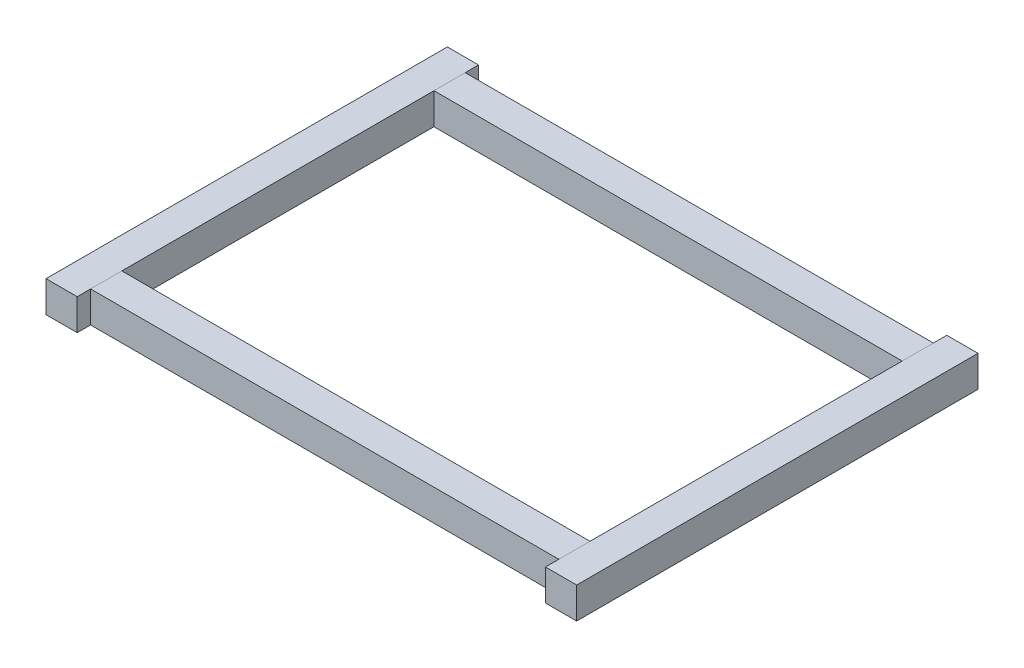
from build123d import *

# Parameters (mm, degrees)
ESQUISSE1_W          = 14
ESQUISSE1_H          = 14
BOSS_EXTRU_1_DEPTH   = 180
BOSS_EXTRU_1_2_DEPTH = 180
BOSS_EXTRU_2_REACH   = 289.701
ESQUISSE2_W          = 14
ESQUISSE2_H          = 14


with BuildPart() as part:
    # Esquisse1 → Boss.-Extru.1 (new body)
    with BuildSketch(Plane.XY):
        with Locations((217, 7)):
            Rectangle(ESQUISSE1_W, ESQUISSE1_H)
    extrude(amount=BOSS_EXTRU_1_DEPTH)


with BuildPart() as body_2:
    # Esquisse1 → Boss.-Extru.1 2 (new body)
    with BuildSketch(Plane.XY):
        with Locations((-7, 7)):
            Rectangle(ESQUISSE1_W, ESQUISSE1_H)
    extrude(amount=BOSS_EXTRU_1_2_DEPTH)


with BuildPart() as body_3:

    # Esquisse2 → Boss.-Extru.2 (new, up to next)
    with BuildSketch(Plane(origin=(0, 0, 0), x_dir=(0, 0, -1), z_dir=(1, 0, 0)), mode=Mode.PRIVATE) as boss_extru_2_sk1:
        with Locations((-13, 7)):
            Rectangle(ESQUISSE2_W, ESQUISSE2_H)
    boss_extru_2_tool1 = extrude(boss_extru_2_sk1.sketch, amount=BOSS_EXTRU_2_REACH, mode=Mode.PRIVATE) - part.part
    # Esquisse2 → Boss.-Extru.2 (new, up to next)
    with BuildSketch(Plane(origin=(0, 0, 0), x_dir=(0, 0, -1), z_dir=(1, 0, 0)), mode=Mode.PRIVATE) as boss_extru_2_sk2:
        with Locations((-167, 7)):
            Rectangle(ESQUISSE2_W, ESQUISSE2_H)
    boss_extru_2_tool2 = extrude(boss_extru_2_sk2.sketch, amount=BOSS_EXTRU_2_REACH, mode=Mode.PRIVATE) - part.part
    add(boss_extru_2_tool1.solids().sort_by_distance((0, 7, 13))[0])
    add(boss_extru_2_tool2.solids().sort_by_distance((0, 7, 167))[0])


solid = Compound([part.part, body_2.part, body_3.part])
